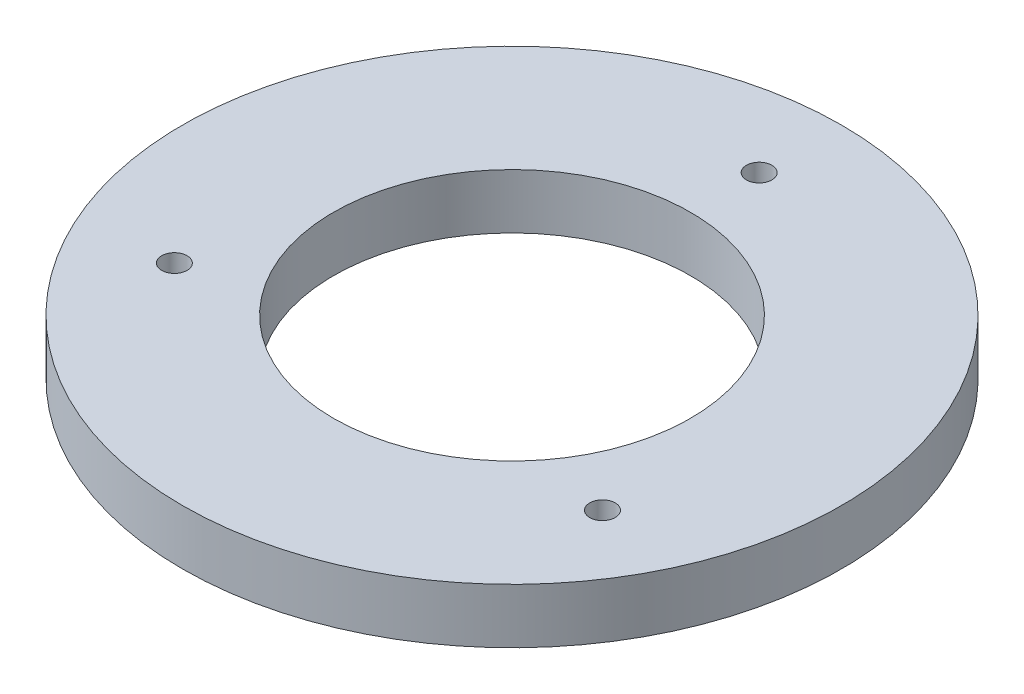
ISO-10303-21;
HEADER;
FILE_DESCRIPTION(('STEP AP214'),'2;1');
FILE_NAME('part.step','',(''),(''),'','','');
FILE_SCHEMA(('AUTOMOTIVE_DESIGN { 1 0 10303 214 1 1 1 1 }'));
ENDSEC;
DATA;
#1=APPLICATION_CONTEXT('core data for automotive mechanical design processes');
#2=APPLICATION_PROTOCOL_DEFINITION('international standard','automotive_design',2000,#1);
#3=PRODUCT_CONTEXT('',#1,'mechanical');
#4=PRODUCT('Part','Part','',(#3));
#5=PRODUCT_RELATED_PRODUCT_CATEGORY('part','',(#4));
#6=PRODUCT_DEFINITION_FORMATION('','',#4);
#7=PRODUCT_DEFINITION_CONTEXT('part definition',#1,'design');
#8=PRODUCT_DEFINITION('design','',#6,#7);
#9=PRODUCT_DEFINITION_SHAPE('','',#8);
#10=(LENGTH_UNIT() NAMED_UNIT(*) SI_UNIT(.MILLI.,.METRE.));
#11=(NAMED_UNIT(*) PLANE_ANGLE_UNIT() SI_UNIT($,.RADIAN.));
#12=(NAMED_UNIT(*) SI_UNIT($,.STERADIAN.) SOLID_ANGLE_UNIT());
#13=UNCERTAINTY_MEASURE_WITH_UNIT(LENGTH_MEASURE(1.E-05),#10,'distance_accuracy_value','');
#14=(GEOMETRIC_REPRESENTATION_CONTEXT(3) GLOBAL_UNCERTAINTY_ASSIGNED_CONTEXT((#13)) GLOBAL_UNIT_ASSIGNED_CONTEXT((#10,
#11,#12)) REPRESENTATION_CONTEXT('',''));
#15=CARTESIAN_POINT('',(0.,0.,0.));
#16=DIRECTION('',(0.,0.,1.));
#17=DIRECTION('',(1.,0.,0.));
#18=AXIS2_PLACEMENT_3D('',#15,#16,#17);
#19=CARTESIAN_POINT('',(0.,6.35,0.));
#20=DIRECTION('',(0.,1.,0.));
#21=DIRECTION('',(0.,0.,1.));
#22=AXIS2_PLACEMENT_3D('',#19,#20,#21);
#23=PLANE('',#22);
#24=CARTESIAN_POINT('',(-24.7466759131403,6.35,14.2875));
#25=DIRECTION('',(0.,1.,0.));
#26=DIRECTION('',(0.,0.,1.));
#27=AXIS2_PLACEMENT_3D('',#24,#25,#26);
#28=CIRCLE('',#27,1.4732);
#29=CARTESIAN_POINT('',(-24.7466759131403,6.35,15.7607));
#30=VERTEX_POINT('',#29);
#31=EDGE_CURVE('E57',#30,#30,#28,.T.);
#32=ORIENTED_EDGE('',*,*,#31,.F.);
#33=EDGE_LOOP('',(#32));
#34=FACE_BOUND('',#33,.T.);
#35=CARTESIAN_POINT('',(0.,6.35,-28.575));
#36=DIRECTION('',(0.,1.,0.));
#37=DIRECTION('',(0.,0.,1.));
#38=AXIS2_PLACEMENT_3D('',#35,#36,#37);
#39=CIRCLE('',#38,1.4732);
#40=CARTESIAN_POINT('',(0.,6.35,-27.1018));
#41=VERTEX_POINT('',#40);
#42=EDGE_CURVE('E46',#41,#41,#39,.T.);
#43=ORIENTED_EDGE('',*,*,#42,.F.);
#44=EDGE_LOOP('',(#43));
#45=FACE_BOUND('',#44,.T.);
#46=CARTESIAN_POINT('',(0.,6.35,0.));
#47=DIRECTION('',(0.,1.,0.));
#48=DIRECTION('',(0.,0.,1.));
#49=AXIS2_PLACEMENT_3D('',#46,#47,#48);
#50=CIRCLE('',#49,38.1);
#51=CARTESIAN_POINT('',(0.,6.35,38.1));
#52=VERTEX_POINT('',#51);
#53=EDGE_CURVE('E10',#52,#52,#50,.T.);
#54=ORIENTED_EDGE('',*,*,#53,.T.);
#55=EDGE_LOOP('',(#54));
#56=FACE_BOUND('',#55,.T.);
#57=CARTESIAN_POINT('',(24.7466759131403,6.35,14.2875));
#58=DIRECTION('',(0.,1.,0.));
#59=DIRECTION('',(0.,0.,1.));
#60=AXIS2_PLACEMENT_3D('',#57,#58,#59);
#61=CIRCLE('',#60,1.4732);
#62=CARTESIAN_POINT('',(24.7466759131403,6.35,15.7607));
#63=VERTEX_POINT('',#62);
#64=EDGE_CURVE('E51',#63,#63,#61,.T.);
#65=ORIENTED_EDGE('',*,*,#64,.F.);
#66=EDGE_LOOP('',(#65));
#67=FACE_BOUND('',#66,.T.);
#68=CARTESIAN_POINT('',(0.,6.35,0.));
#69=DIRECTION('',(0.,1.,0.));
#70=DIRECTION('',(0.,0.,1.));
#71=AXIS2_PLACEMENT_3D('',#68,#69,#70);
#72=CIRCLE('',#71,20.6375);
#73=CARTESIAN_POINT('',(0.,6.35,20.6375));
#74=VERTEX_POINT('',#73);
#75=EDGE_CURVE('E63',#74,#74,#72,.T.);
#76=ORIENTED_EDGE('',*,*,#75,.F.);
#77=EDGE_LOOP('',(#76));
#78=FACE_BOUND('',#77,.T.);
#79=ADVANCED_FACE('F35',(#34,#45,#56,#67,#78),#23,.T.);
#80=CARTESIAN_POINT('',(0.,0.,0.));
#81=DIRECTION('',(0.,1.,0.));
#82=DIRECTION('',(0.,0.,1.));
#83=AXIS2_PLACEMENT_3D('',#80,#81,#82);
#84=PLANE('',#83);
#85=CARTESIAN_POINT('',(0.,0.,0.));
#86=DIRECTION('',(0.,1.,0.));
#87=DIRECTION('',(0.,0.,1.));
#88=AXIS2_PLACEMENT_3D('',#85,#86,#87);
#89=CIRCLE('',#88,38.1);
#90=CARTESIAN_POINT('',(0.,0.,38.1));
#91=VERTEX_POINT('',#90);
#92=EDGE_CURVE('E39',#91,#91,#89,.T.);
#93=ORIENTED_EDGE('',*,*,#92,.F.);
#94=EDGE_LOOP('',(#93));
#95=FACE_BOUND('',#94,.T.);
#96=CARTESIAN_POINT('',(0.,0.,-28.575));
#97=DIRECTION('',(0.,1.,0.));
#98=DIRECTION('',(0.,0.,1.));
#99=AXIS2_PLACEMENT_3D('',#96,#97,#98);
#100=CIRCLE('',#99,1.4732);
#101=CARTESIAN_POINT('',(0.,0.,-27.1018));
#102=VERTEX_POINT('',#101);
#103=EDGE_CURVE('E48',#102,#102,#100,.T.);
#104=ORIENTED_EDGE('',*,*,#103,.T.);
#105=EDGE_LOOP('',(#104));
#106=FACE_BOUND('',#105,.T.);
#107=CARTESIAN_POINT('',(24.7466759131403,0.,14.2875));
#108=DIRECTION('',(0.,1.,0.));
#109=DIRECTION('',(0.,0.,1.));
#110=AXIS2_PLACEMENT_3D('',#107,#108,#109);
#111=CIRCLE('',#110,1.4732);
#112=CARTESIAN_POINT('',(24.7466759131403,0.,15.7607));
#113=VERTEX_POINT('',#112);
#114=EDGE_CURVE('E54',#113,#113,#111,.T.);
#115=ORIENTED_EDGE('',*,*,#114,.T.);
#116=EDGE_LOOP('',(#115));
#117=FACE_BOUND('',#116,.T.);
#118=CARTESIAN_POINT('',(-24.7466759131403,0.,14.2875));
#119=DIRECTION('',(0.,1.,0.));
#120=DIRECTION('',(0.,0.,1.));
#121=AXIS2_PLACEMENT_3D('',#118,#119,#120);
#122=CIRCLE('',#121,1.4732);
#123=CARTESIAN_POINT('',(-24.7466759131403,0.,15.7607));
#124=VERTEX_POINT('',#123);
#125=EDGE_CURVE('E60',#124,#124,#122,.T.);
#126=ORIENTED_EDGE('',*,*,#125,.T.);
#127=EDGE_LOOP('',(#126));
#128=FACE_BOUND('',#127,.T.);
#129=CARTESIAN_POINT('',(0.,0.,0.));
#130=DIRECTION('',(0.,1.,0.));
#131=DIRECTION('',(0.,0.,1.));
#132=AXIS2_PLACEMENT_3D('',#129,#130,#131);
#133=CIRCLE('',#132,20.6375);
#134=CARTESIAN_POINT('',(0.,0.,20.6375));
#135=VERTEX_POINT('',#134);
#136=EDGE_CURVE('E66',#135,#135,#133,.T.);
#137=ORIENTED_EDGE('',*,*,#136,.T.);
#138=EDGE_LOOP('',(#137));
#139=FACE_BOUND('',#138,.T.);
#140=ADVANCED_FACE('F76',(#95,#106,#117,#128,#139),#84,.F.);
#141=CARTESIAN_POINT('',(0.,6.35,0.));
#142=DIRECTION('',(0.,-1.,0.));
#143=DIRECTION('',(0.,0.,-1.));
#144=AXIS2_PLACEMENT_3D('',#141,#142,#143);
#145=CYLINDRICAL_SURFACE('',#144,38.1);
#146=ORIENTED_EDGE('',*,*,#53,.F.);
#147=EDGE_LOOP('',(#146));
#148=FACE_BOUND('',#147,.T.);
#149=ORIENTED_EDGE('',*,*,#92,.T.);
#150=EDGE_LOOP('',(#149));
#151=FACE_BOUND('',#150,.T.);
#152=ADVANCED_FACE('F37',(#148,#151),#145,.T.);
#153=CARTESIAN_POINT('',(0.,6.35,-28.575));
#154=DIRECTION('',(0.,-1.,0.));
#155=DIRECTION('',(0.,0.,-1.));
#156=AXIS2_PLACEMENT_3D('',#153,#154,#155);
#157=CYLINDRICAL_SURFACE('',#156,1.4732);
#158=ORIENTED_EDGE('',*,*,#42,.T.);
#159=EDGE_LOOP('',(#158));
#160=FACE_BOUND('',#159,.T.);
#161=ORIENTED_EDGE('',*,*,#103,.F.);
#162=EDGE_LOOP('',(#161));
#163=FACE_BOUND('',#162,.T.);
#164=ADVANCED_FACE('F86',(#160,#163),#157,.F.);
#165=CARTESIAN_POINT('',(24.7466759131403,6.35,14.2875));
#166=DIRECTION('',(0.,-1.,0.));
#167=DIRECTION('',(0.,0.,-1.));
#168=AXIS2_PLACEMENT_3D('',#165,#166,#167);
#169=CYLINDRICAL_SURFACE('',#168,1.4732);
#170=ORIENTED_EDGE('',*,*,#64,.T.);
#171=EDGE_LOOP('',(#170));
#172=FACE_BOUND('',#171,.T.);
#173=ORIENTED_EDGE('',*,*,#114,.F.);
#174=EDGE_LOOP('',(#173));
#175=FACE_BOUND('',#174,.T.);
#176=ADVANCED_FACE('F89',(#172,#175),#169,.F.);
#177=CARTESIAN_POINT('',(-24.7466759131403,6.35,14.2875));
#178=DIRECTION('',(0.,-1.,0.));
#179=DIRECTION('',(0.,0.,-1.));
#180=AXIS2_PLACEMENT_3D('',#177,#178,#179);
#181=CYLINDRICAL_SURFACE('',#180,1.4732);
#182=ORIENTED_EDGE('',*,*,#31,.T.);
#183=EDGE_LOOP('',(#182));
#184=FACE_BOUND('',#183,.T.);
#185=ORIENTED_EDGE('',*,*,#125,.F.);
#186=EDGE_LOOP('',(#185));
#187=FACE_BOUND('',#186,.T.);
#188=ADVANCED_FACE('F93',(#184,#187),#181,.F.);
#189=CARTESIAN_POINT('',(0.,6.35,0.));
#190=DIRECTION('',(0.,-1.,0.));
#191=DIRECTION('',(0.,0.,-1.));
#192=AXIS2_PLACEMENT_3D('',#189,#190,#191);
#193=CYLINDRICAL_SURFACE('',#192,20.6375);
#194=ORIENTED_EDGE('',*,*,#75,.T.);
#195=EDGE_LOOP('',(#194));
#196=FACE_BOUND('',#195,.T.);
#197=ORIENTED_EDGE('',*,*,#136,.F.);
#198=EDGE_LOOP('',(#197));
#199=FACE_BOUND('',#198,.T.);
#200=ADVANCED_FACE('F72',(#196,#199),#193,.F.);
#201=CLOSED_SHELL('',(#79,#140,#152,#164,#176,#188,#200));
#202=MANIFOLD_SOLID_BREP('B2',#201);
#203=ADVANCED_BREP_SHAPE_REPRESENTATION('',(#18,#202),#14);
#204=SHAPE_DEFINITION_REPRESENTATION(#9,#203);
ENDSEC;
END-ISO-10303-21;
